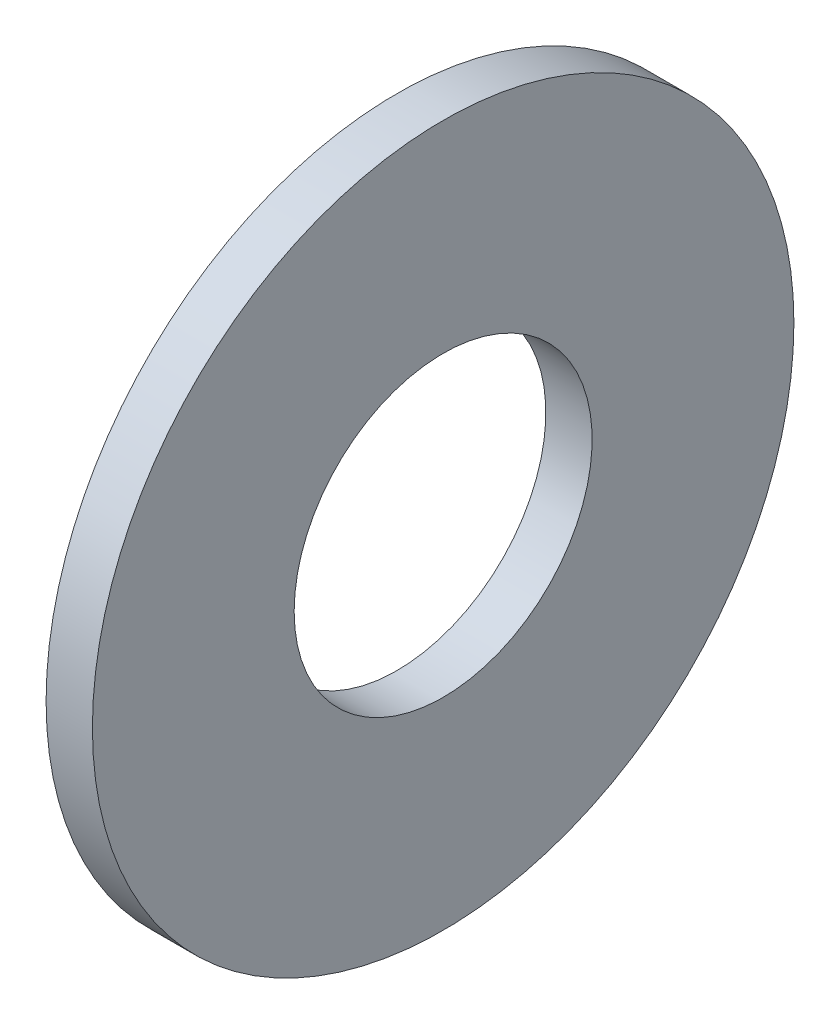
from build123d import *

# Parameters (mm, degrees)
SKETCH1_W = 4.191
SKETCH1_H = 18.2626


with BuildPart() as part:
    # Sketch1 → Base-Revolve (revolve)
    with BuildSketch(Plane.XY, mode=Mode.PRIVATE) as base_revolve_sk:
        with Locations((-2.0955, 22.6187)):
            Rectangle(SKETCH1_W, SKETCH1_H)
    revolve(base_revolve_sk.sketch.rotate(Axis((-34.925, 0, 0), (1, 0, 0)), 90), axis=Axis((-34.925, 0, 0), (1, 0, 0)))


solid = part.part
